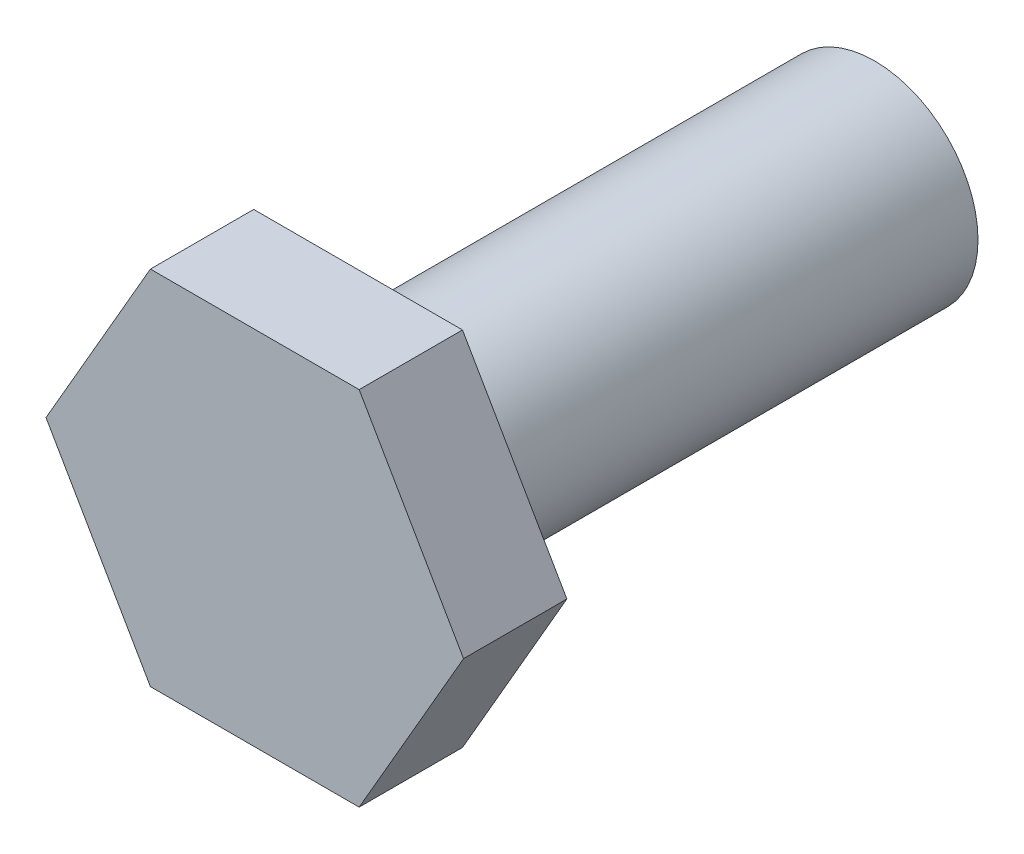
ISO-10303-21;
HEADER;
FILE_DESCRIPTION(('STEP AP214'),'2;1');
FILE_NAME('part.step','',(''),(''),'','','');
FILE_SCHEMA(('AUTOMOTIVE_DESIGN { 1 0 10303 214 1 1 1 1 }'));
ENDSEC;
DATA;
#1=APPLICATION_CONTEXT('core data for automotive mechanical design processes');
#2=APPLICATION_PROTOCOL_DEFINITION('international standard','automotive_design',2000,#1);
#3=PRODUCT_CONTEXT('',#1,'mechanical');
#4=PRODUCT('Part','Part','',(#3));
#5=PRODUCT_RELATED_PRODUCT_CATEGORY('part','',(#4));
#6=PRODUCT_DEFINITION_FORMATION('','',#4);
#7=PRODUCT_DEFINITION_CONTEXT('part definition',#1,'design');
#8=PRODUCT_DEFINITION('design','',#6,#7);
#9=PRODUCT_DEFINITION_SHAPE('','',#8);
#10=(LENGTH_UNIT() NAMED_UNIT(*) SI_UNIT(.MILLI.,.METRE.));
#11=(NAMED_UNIT(*) PLANE_ANGLE_UNIT() SI_UNIT($,.RADIAN.));
#12=(NAMED_UNIT(*) SI_UNIT($,.STERADIAN.) SOLID_ANGLE_UNIT());
#13=UNCERTAINTY_MEASURE_WITH_UNIT(LENGTH_MEASURE(1.E-05),#10,'distance_accuracy_value','');
#14=(GEOMETRIC_REPRESENTATION_CONTEXT(3) GLOBAL_UNCERTAINTY_ASSIGNED_CONTEXT((#13)) GLOBAL_UNIT_ASSIGNED_CONTEXT((#10,
#11,#12)) REPRESENTATION_CONTEXT('',''));
#15=CARTESIAN_POINT('',(0.,0.,0.));
#16=DIRECTION('',(0.,0.,1.));
#17=DIRECTION('',(1.,0.,0.));
#18=AXIS2_PLACEMENT_3D('',#15,#16,#17);
#19=CARTESIAN_POINT('',(30.5326438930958,19.05,0.));
#20=DIRECTION('',(0.,0.,-1.));
#21=DIRECTION('',(-1.,0.,0.));
#22=AXIS2_PLACEMENT_3D('',#19,#20,#21);
#23=PLANE('',#22);
#24=DIRECTION('',(-0.5,0.866025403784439,0.));
#25=VECTOR('',#24,1.);
#26=CARTESIAN_POINT('',(30.5326438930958,19.05,0.));
#27=LINE('',#26,#25);
#28=CARTESIAN_POINT('',(30.5326438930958,19.05,0.));
#29=VERTEX_POINT('',#28);
#30=CARTESIAN_POINT('',(27.9663219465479,23.495,0.));
#31=VERTEX_POINT('',#30);
#32=EDGE_CURVE('E81',#29,#31,#27,.T.);
#33=ORIENTED_EDGE('',*,*,#32,.F.);
#34=DIRECTION('',(0.5,0.866025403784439,0.));
#35=VECTOR('',#34,1.);
#36=CARTESIAN_POINT('',(27.9663219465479,14.605,0.));
#37=LINE('',#36,#35);
#38=CARTESIAN_POINT('',(27.9663219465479,14.605,0.));
#39=VERTEX_POINT('',#38);
#40=EDGE_CURVE('E107',#39,#29,#37,.T.);
#41=ORIENTED_EDGE('',*,*,#40,.F.);
#42=DIRECTION('',(1.,0.,0.));
#43=VECTOR('',#42,1.);
#44=CARTESIAN_POINT('',(22.8336780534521,14.605,0.));
#45=LINE('',#44,#43);
#46=CARTESIAN_POINT('',(22.8336780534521,14.605,0.));
#47=VERTEX_POINT('',#46);
#48=EDGE_CURVE('E105',#47,#39,#45,.T.);
#49=ORIENTED_EDGE('',*,*,#48,.F.);
#50=DIRECTION('',(0.5,-0.866025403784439,0.));
#51=VECTOR('',#50,1.);
#52=CARTESIAN_POINT('',(20.2673561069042,19.05,0.));
#53=LINE('',#52,#51);
#54=CARTESIAN_POINT('',(20.2673561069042,19.05,0.));
#55=VERTEX_POINT('',#54);
#56=EDGE_CURVE('E103',#55,#47,#53,.T.);
#57=ORIENTED_EDGE('',*,*,#56,.F.);
#58=DIRECTION('',(-0.5,-0.866025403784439,0.));
#59=VECTOR('',#58,1.);
#60=CARTESIAN_POINT('',(22.8336780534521,23.495,0.));
#61=LINE('',#60,#59);
#62=CARTESIAN_POINT('',(22.8336780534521,23.495,0.));
#63=VERTEX_POINT('',#62);
#64=EDGE_CURVE('E83',#63,#55,#61,.T.);
#65=ORIENTED_EDGE('',*,*,#64,.F.);
#66=DIRECTION('',(-1.,0.,0.));
#67=VECTOR('',#66,1.);
#68=CARTESIAN_POINT('',(27.9663219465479,23.495,0.));
#69=LINE('',#68,#67);
#70=EDGE_CURVE('E77',#31,#63,#69,.T.);
#71=ORIENTED_EDGE('',*,*,#70,.F.);
#72=EDGE_LOOP('',(#33,#41,#49,#57,#65,#71));
#73=FACE_BOUND('',#72,.T.);
#74=CARTESIAN_POINT('',(25.4,19.05,0.));
#75=DIRECTION('',(0.,0.,-1.));
#76=DIRECTION('',(-1.,0.,0.));
#77=AXIS2_PLACEMENT_3D('',#74,#75,#76);
#78=CIRCLE('',#77,2.54);
#79=CARTESIAN_POINT('',(22.86,19.05,0.));
#80=VERTEX_POINT('',#79);
#81=EDGE_CURVE('E98',#80,#80,#78,.T.);
#82=ORIENTED_EDGE('',*,*,#81,.F.);
#83=EDGE_LOOP('',(#82));
#84=FACE_BOUND('',#83,.T.);
#85=ADVANCED_FACE('F24',(#73,#84),#23,.T.);
#86=CARTESIAN_POINT('',(30.5326438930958,19.05,2.54));
#87=DIRECTION('',(-0.866025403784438,-0.5,0.));
#88=DIRECTION('',(0.5,-0.866025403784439,0.));
#89=AXIS2_PLACEMENT_3D('',#86,#87,#88);
#90=PLANE('',#89);
#91=ORIENTED_EDGE('',*,*,#32,.T.);
#92=DIRECTION('',(0.,0.,-1.));
#93=VECTOR('',#92,1.);
#94=CARTESIAN_POINT('',(27.9663219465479,23.495,2.54));
#95=LINE('',#94,#93);
#96=CARTESIAN_POINT('',(27.9663219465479,23.495,2.54));
#97=VERTEX_POINT('',#96);
#98=EDGE_CURVE('E11',#97,#31,#95,.T.);
#99=ORIENTED_EDGE('',*,*,#98,.F.);
#100=DIRECTION('',(-0.5,0.866025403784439,0.));
#101=VECTOR('',#100,1.);
#102=CARTESIAN_POINT('',(30.5326438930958,19.05,2.54));
#103=LINE('',#102,#101);
#104=CARTESIAN_POINT('',(30.5326438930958,19.05,2.54));
#105=VERTEX_POINT('',#104);
#106=EDGE_CURVE('E109',#105,#97,#103,.T.);
#107=ORIENTED_EDGE('',*,*,#106,.F.);
#108=DIRECTION('',(0.,0.,-1.));
#109=VECTOR('',#108,1.);
#110=CARTESIAN_POINT('',(30.5326438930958,19.05,2.54));
#111=LINE('',#110,#109);
#112=EDGE_CURVE('E94',#105,#29,#111,.T.);
#113=ORIENTED_EDGE('',*,*,#112,.T.);
#114=EDGE_LOOP('',(#91,#99,#107,#113));
#115=FACE_BOUND('',#114,.T.);
#116=ADVANCED_FACE('F26',(#115),#90,.F.);
#117=CARTESIAN_POINT('',(27.9663219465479,23.495,2.54));
#118=DIRECTION('',(0.,-1.,0.));
#119=DIRECTION('',(0.,0.,-1.));
#120=AXIS2_PLACEMENT_3D('',#117,#118,#119);
#121=PLANE('',#120);
#122=ORIENTED_EDGE('',*,*,#70,.T.);
#123=DIRECTION('',(0.,0.,-1.));
#124=VECTOR('',#123,1.);
#125=CARTESIAN_POINT('',(22.8336780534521,23.495,2.54));
#126=LINE('',#125,#124);
#127=CARTESIAN_POINT('',(22.8336780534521,23.495,2.54));
#128=VERTEX_POINT('',#127);
#129=EDGE_CURVE('E32',#128,#63,#126,.T.);
#130=ORIENTED_EDGE('',*,*,#129,.F.);
#131=DIRECTION('',(-1.,0.,0.));
#132=VECTOR('',#131,1.);
#133=CARTESIAN_POINT('',(27.9663219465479,23.495,2.54));
#134=LINE('',#133,#132);
#135=EDGE_CURVE('E90',#97,#128,#134,.T.);
#136=ORIENTED_EDGE('',*,*,#135,.F.);
#137=ORIENTED_EDGE('',*,*,#98,.T.);
#138=EDGE_LOOP('',(#122,#130,#136,#137));
#139=FACE_BOUND('',#138,.T.);
#140=ADVANCED_FACE('F89',(#139),#121,.F.);
#141=CARTESIAN_POINT('',(22.8336780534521,23.495,2.54));
#142=DIRECTION('',(0.866025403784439,-0.5,0.));
#143=DIRECTION('',(0.5,0.866025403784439,0.));
#144=AXIS2_PLACEMENT_3D('',#141,#142,#143);
#145=PLANE('',#144);
#146=ORIENTED_EDGE('',*,*,#64,.T.);
#147=DIRECTION('',(0.,0.,-1.));
#148=VECTOR('',#147,1.);
#149=CARTESIAN_POINT('',(20.2673561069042,19.05,2.54));
#150=LINE('',#149,#148);
#151=CARTESIAN_POINT('',(20.2673561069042,19.05,2.54));
#152=VERTEX_POINT('',#151);
#153=EDGE_CURVE('E125',#152,#55,#150,.T.);
#154=ORIENTED_EDGE('',*,*,#153,.F.);
#155=DIRECTION('',(-0.5,-0.866025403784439,0.));
#156=VECTOR('',#155,1.);
#157=CARTESIAN_POINT('',(22.8336780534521,23.495,2.54));
#158=LINE('',#157,#156);
#159=EDGE_CURVE('E112',#128,#152,#158,.T.);
#160=ORIENTED_EDGE('',*,*,#159,.F.);
#161=ORIENTED_EDGE('',*,*,#129,.T.);
#162=EDGE_LOOP('',(#146,#154,#160,#161));
#163=FACE_BOUND('',#162,.T.);
#164=ADVANCED_FACE('F129',(#163),#145,.F.);
#165=CARTESIAN_POINT('',(20.2673561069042,19.05,2.54));
#166=DIRECTION('',(0.866025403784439,0.5,0.));
#167=DIRECTION('',(-0.5,0.866025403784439,0.));
#168=AXIS2_PLACEMENT_3D('',#165,#166,#167);
#169=PLANE('',#168);
#170=ORIENTED_EDGE('',*,*,#56,.T.);
#171=DIRECTION('',(0.,0.,-1.));
#172=VECTOR('',#171,1.);
#173=CARTESIAN_POINT('',(22.8336780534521,14.605,2.54));
#174=LINE('',#173,#172);
#175=CARTESIAN_POINT('',(22.8336780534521,14.605,2.54));
#176=VERTEX_POINT('',#175);
#177=EDGE_CURVE('E122',#176,#47,#174,.T.);
#178=ORIENTED_EDGE('',*,*,#177,.F.);
#179=DIRECTION('',(0.5,-0.866025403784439,0.));
#180=VECTOR('',#179,1.);
#181=CARTESIAN_POINT('',(20.2673561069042,19.05,2.54));
#182=LINE('',#181,#180);
#183=EDGE_CURVE('E114',#152,#176,#182,.T.);
#184=ORIENTED_EDGE('',*,*,#183,.F.);
#185=ORIENTED_EDGE('',*,*,#153,.T.);
#186=EDGE_LOOP('',(#170,#178,#184,#185));
#187=FACE_BOUND('',#186,.T.);
#188=ADVANCED_FACE('F135',(#187),#169,.F.);
#189=CARTESIAN_POINT('',(22.8336780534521,14.605,2.54));
#190=DIRECTION('',(0.,1.,0.));
#191=DIRECTION('',(-1.,0.,0.));
#192=AXIS2_PLACEMENT_3D('',#189,#190,#191);
#193=PLANE('',#192);
#194=ORIENTED_EDGE('',*,*,#48,.T.);
#195=DIRECTION('',(0.,0.,-1.));
#196=VECTOR('',#195,1.);
#197=CARTESIAN_POINT('',(27.9663219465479,14.605,2.54));
#198=LINE('',#197,#196);
#199=CARTESIAN_POINT('',(27.9663219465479,14.605,2.54));
#200=VERTEX_POINT('',#199);
#201=EDGE_CURVE('E119',#200,#39,#198,.T.);
#202=ORIENTED_EDGE('',*,*,#201,.F.);
#203=DIRECTION('',(1.,0.,0.));
#204=VECTOR('',#203,1.);
#205=CARTESIAN_POINT('',(22.8336780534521,14.605,2.54));
#206=LINE('',#205,#204);
#207=EDGE_CURVE('E44',#176,#200,#206,.T.);
#208=ORIENTED_EDGE('',*,*,#207,.F.);
#209=ORIENTED_EDGE('',*,*,#177,.T.);
#210=EDGE_LOOP('',(#194,#202,#208,#209));
#211=FACE_BOUND('',#210,.T.);
#212=ADVANCED_FACE('F138',(#211),#193,.F.);
#213=CARTESIAN_POINT('',(27.9663219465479,14.605,2.54));
#214=DIRECTION('',(-0.866025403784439,0.5,0.));
#215=DIRECTION('',(-0.5,-0.866025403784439,0.));
#216=AXIS2_PLACEMENT_3D('',#213,#214,#215);
#217=PLANE('',#216);
#218=ORIENTED_EDGE('',*,*,#40,.T.);
#219=ORIENTED_EDGE('',*,*,#112,.F.);
#220=DIRECTION('',(0.5,0.866025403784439,0.));
#221=VECTOR('',#220,1.);
#222=CARTESIAN_POINT('',(27.9663219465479,14.605,2.54));
#223=LINE('',#222,#221);
#224=EDGE_CURVE('E39',#200,#105,#223,.T.);
#225=ORIENTED_EDGE('',*,*,#224,.F.);
#226=ORIENTED_EDGE('',*,*,#201,.T.);
#227=EDGE_LOOP('',(#218,#219,#225,#226));
#228=FACE_BOUND('',#227,.T.);
#229=ADVANCED_FACE('F140',(#228),#217,.F.);
#230=CARTESIAN_POINT('',(30.5326438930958,19.05,2.54));
#231=DIRECTION('',(0.,0.,-1.));
#232=DIRECTION('',(-1.,0.,0.));
#233=AXIS2_PLACEMENT_3D('',#230,#231,#232);
#234=PLANE('',#233);
#235=ORIENTED_EDGE('',*,*,#106,.T.);
#236=ORIENTED_EDGE('',*,*,#135,.T.);
#237=ORIENTED_EDGE('',*,*,#159,.T.);
#238=ORIENTED_EDGE('',*,*,#183,.T.);
#239=ORIENTED_EDGE('',*,*,#207,.T.);
#240=ORIENTED_EDGE('',*,*,#224,.T.);
#241=EDGE_LOOP('',(#235,#236,#237,#238,#239,#240));
#242=FACE_BOUND('',#241,.T.);
#243=ADVANCED_FACE('F132',(#242),#234,.F.);
#244=CARTESIAN_POINT('',(25.4,19.05,-12.7));
#245=DIRECTION('',(0.,0.,1.));
#246=DIRECTION('',(1.,0.,0.));
#247=AXIS2_PLACEMENT_3D('',#244,#245,#246);
#248=CYLINDRICAL_SURFACE('',#247,2.54);
#249=CARTESIAN_POINT('',(25.4,19.05,-12.7));
#250=DIRECTION('',(0.,0.,-1.));
#251=DIRECTION('',(-1.,0.,0.));
#252=AXIS2_PLACEMENT_3D('',#249,#250,#251);
#253=CIRCLE('',#252,2.54);
#254=CARTESIAN_POINT('',(22.86,19.05,-12.7));
#255=VERTEX_POINT('',#254);
#256=EDGE_CURVE('E95',#255,#255,#253,.T.);
#257=ORIENTED_EDGE('',*,*,#256,.F.);
#258=EDGE_LOOP('',(#257));
#259=FACE_BOUND('',#258,.T.);
#260=ORIENTED_EDGE('',*,*,#81,.T.);
#261=EDGE_LOOP('',(#260));
#262=FACE_BOUND('',#261,.T.);
#263=ADVANCED_FACE('F147',(#259,#262),#248,.T.);
#264=CARTESIAN_POINT('',(25.4,19.05,-12.7));
#265=DIRECTION('',(0.,0.,-1.));
#266=DIRECTION('',(-1.,0.,0.));
#267=AXIS2_PLACEMENT_3D('',#264,#265,#266);
#268=PLANE('',#267);
#269=ORIENTED_EDGE('',*,*,#256,.T.);
#270=EDGE_LOOP('',(#269));
#271=FACE_BOUND('',#270,.T.);
#272=ADVANCED_FACE('F158',(#271),#268,.T.);
#273=CLOSED_SHELL('',(#85,#116,#140,#164,#188,#212,#229,#243,#263,#272));
#274=MANIFOLD_SOLID_BREP('B2',#273);
#275=ADVANCED_BREP_SHAPE_REPRESENTATION('',(#18,#274),#14);
#276=SHAPE_DEFINITION_REPRESENTATION(#9,#275);
ENDSEC;
END-ISO-10303-21;
